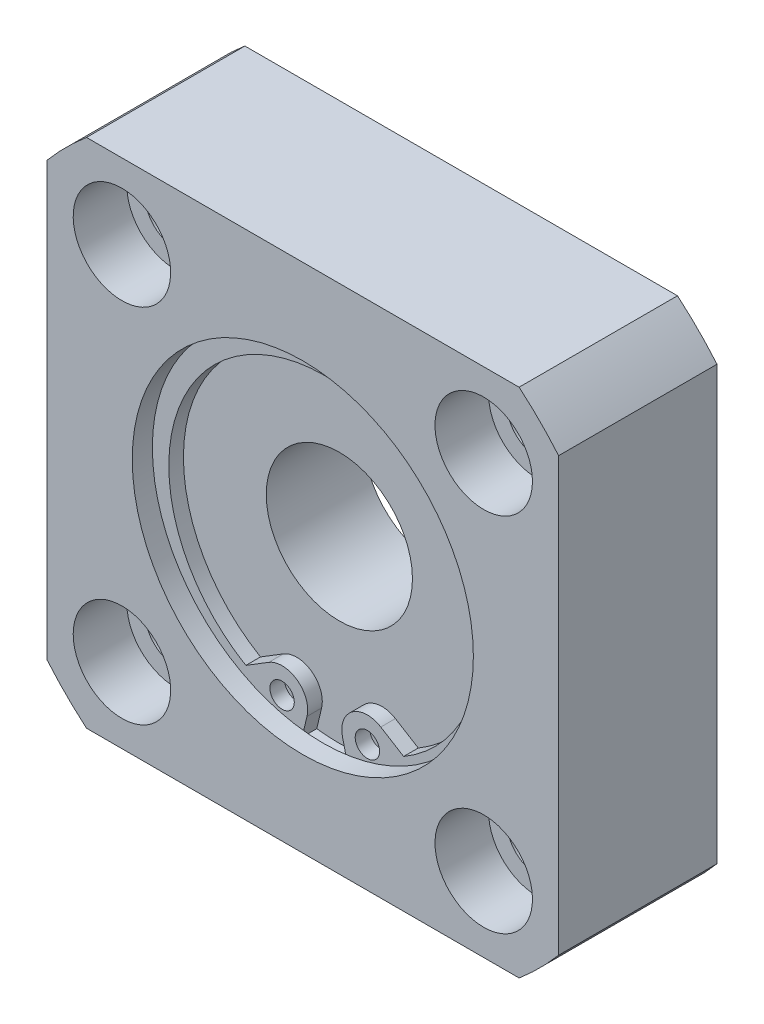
ISO-10303-21;
HEADER;
FILE_DESCRIPTION(('STEP AP214'),'2;1');
FILE_NAME('part.step','',(''),(''),'','','');
FILE_SCHEMA(('AUTOMOTIVE_DESIGN { 1 0 10303 214 1 1 1 1 }'));
ENDSEC;
DATA;
#1=APPLICATION_CONTEXT('core data for automotive mechanical design processes');
#2=APPLICATION_PROTOCOL_DEFINITION('international standard','automotive_design',2000,#1);
#3=PRODUCT_CONTEXT('',#1,'mechanical');
#4=PRODUCT('Part','Part','',(#3));
#5=PRODUCT_RELATED_PRODUCT_CATEGORY('part','',(#4));
#6=PRODUCT_DEFINITION_FORMATION('','',#4);
#7=PRODUCT_DEFINITION_CONTEXT('part definition',#1,'design');
#8=PRODUCT_DEFINITION('design','',#6,#7);
#9=PRODUCT_DEFINITION_SHAPE('','',#8);
#10=(LENGTH_UNIT() NAMED_UNIT(*) SI_UNIT(.MILLI.,.METRE.));
#11=(NAMED_UNIT(*) PLANE_ANGLE_UNIT() SI_UNIT($,.RADIAN.));
#12=(NAMED_UNIT(*) SI_UNIT($,.STERADIAN.) SOLID_ANGLE_UNIT());
#13=UNCERTAINTY_MEASURE_WITH_UNIT(LENGTH_MEASURE(1.E-05),#10,'distance_accuracy_value','');
#14=(GEOMETRIC_REPRESENTATION_CONTEXT(3) GLOBAL_UNCERTAINTY_ASSIGNED_CONTEXT((#13)) GLOBAL_UNIT_ASSIGNED_CONTEXT((#10,
#11,#12)) REPRESENTATION_CONTEXT('',''));
#15=CARTESIAN_POINT('',(0.,0.,0.));
#16=DIRECTION('',(0.,0.,1.));
#17=DIRECTION('',(1.,0.,0.));
#18=AXIS2_PLACEMENT_3D('',#15,#16,#17);
#19=CARTESIAN_POINT('',(0.,0.,10.));
#20=DIRECTION('',(0.,0.,1.));
#21=DIRECTION('',(1.,0.,0.));
#22=AXIS2_PLACEMENT_3D('',#19,#20,#21);
#23=PLANE('',#22);
#24=CARTESIAN_POINT('',(3.5,-12.4249666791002,10.));
#25=DIRECTION('',(0.,0.,1.));
#26=DIRECTION('',(1.,0.,0.));
#27=AXIS2_PLACEMENT_3D('',#24,#25,#26);
#28=CIRCLE('',#27,1.);
#29=CARTESIAN_POINT('',(4.5,-12.4249666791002,10.));
#30=VERTEX_POINT('',#29);
#31=EDGE_CURVE('E182',#30,#30,#28,.T.);
#32=ORIENTED_EDGE('',*,*,#31,.T.);
#33=EDGE_LOOP('',(#32));
#34=FACE_BOUND('',#33,.T.);
#35=ADVANCED_FACE('F14',(#34),#23,.T.);
#36=CARTESIAN_POINT('',(-3.5,-12.4249666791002,10.));
#37=DIRECTION('',(0.,0.,-1.));
#38=DIRECTION('',(1.,0.,0.));
#39=AXIS2_PLACEMENT_3D('',#36,#37,#38);
#40=CIRCLE('',#39,1.);
#41=CARTESIAN_POINT('',(-2.5,-12.4249666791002,10.));
#42=VERTEX_POINT('',#41);
#43=EDGE_CURVE('E174',#42,#42,#40,.T.);
#44=ORIENTED_EDGE('',*,*,#43,.F.);
#45=EDGE_LOOP('',(#44));
#46=FACE_BOUND('',#45,.T.);
#47=ADVANCED_FACE('F387',(#46),#23,.T.);
#48=CARTESIAN_POINT('',(14.8492424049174,14.8492424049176,8.6));
#49=DIRECTION('',(0.,0.,1.));
#50=DIRECTION('',(1.,0.,0.));
#51=AXIS2_PLACEMENT_3D('',#48,#49,#50);
#52=PLANE('',#51);
#53=CARTESIAN_POINT('',(14.8492424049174,14.8492424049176,8.6));
#54=DIRECTION('',(0.,0.,1.));
#55=DIRECTION('',(1.,0.,0.));
#56=AXIS2_PLACEMENT_3D('',#53,#54,#55);
#57=CIRCLE('',#56,4.);
#58=CARTESIAN_POINT('',(18.8492424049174,14.8492424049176,8.6));
#59=VERTEX_POINT('',#58);
#60=EDGE_CURVE('E284',#59,#59,#57,.T.);
#61=ORIENTED_EDGE('',*,*,#60,.T.);
#62=EDGE_LOOP('',(#61));
#63=FACE_BOUND('',#62,.T.);
#64=CARTESIAN_POINT('',(14.8492424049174,14.8492424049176,8.6));
#65=DIRECTION('',(0.,0.,1.));
#66=DIRECTION('',(1.,0.,0.));
#67=AXIS2_PLACEMENT_3D('',#64,#65,#66);
#68=CIRCLE('',#67,2.5);
#69=CARTESIAN_POINT('',(17.3492424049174,14.8492424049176,8.6));
#70=VERTEX_POINT('',#69);
#71=EDGE_CURVE('E287',#70,#70,#68,.F.);
#72=ORIENTED_EDGE('',*,*,#71,.T.);
#73=EDGE_LOOP('',(#72));
#74=FACE_BOUND('',#73,.T.);
#75=ADVANCED_FACE('F395',(#63,#74),#52,.T.);
#76=CARTESIAN_POINT('',(14.8492424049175,-14.8492424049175,8.6));
#77=DIRECTION('',(0.,0.,1.));
#78=DIRECTION('',(0.,-1.,0.));
#79=AXIS2_PLACEMENT_3D('',#76,#77,#78);
#80=PLANE('',#79);
#81=CARTESIAN_POINT('',(14.8492424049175,-14.8492424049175,8.6));
#82=DIRECTION('',(0.,0.,1.));
#83=DIRECTION('',(0.,-1.,0.));
#84=AXIS2_PLACEMENT_3D('',#81,#82,#83);
#85=CIRCLE('',#84,4.);
#86=CARTESIAN_POINT('',(14.8492424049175,-18.8492424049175,8.6));
#87=VERTEX_POINT('',#86);
#88=EDGE_CURVE('E268',#87,#87,#85,.T.);
#89=ORIENTED_EDGE('',*,*,#88,.T.);
#90=EDGE_LOOP('',(#89));
#91=FACE_BOUND('',#90,.T.);
#92=CARTESIAN_POINT('',(14.8492424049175,-14.8492424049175,8.6));
#93=DIRECTION('',(0.,0.,1.));
#94=DIRECTION('',(1.,0.,0.));
#95=AXIS2_PLACEMENT_3D('',#92,#93,#94);
#96=CIRCLE('',#95,2.5);
#97=CARTESIAN_POINT('',(17.3492424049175,-14.8492424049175,8.6));
#98=VERTEX_POINT('',#97);
#99=EDGE_CURVE('E271',#98,#98,#96,.F.);
#100=ORIENTED_EDGE('',*,*,#99,.T.);
#101=EDGE_LOOP('',(#100));
#102=FACE_BOUND('',#101,.T.);
#103=ADVANCED_FACE('F826',(#91,#102),#80,.T.);
#104=CARTESIAN_POINT('',(-14.8492424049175,-14.8492424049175,8.6));
#105=DIRECTION('',(0.,0.,1.));
#106=DIRECTION('',(-1.,0.,0.));
#107=AXIS2_PLACEMENT_3D('',#104,#105,#106);
#108=PLANE('',#107);
#109=CARTESIAN_POINT('',(-14.8492424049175,-14.8492424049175,8.6));
#110=DIRECTION('',(0.,0.,1.));
#111=DIRECTION('',(-1.,0.,0.));
#112=AXIS2_PLACEMENT_3D('',#109,#110,#111);
#113=CIRCLE('',#112,4.);
#114=CARTESIAN_POINT('',(-18.8492424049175,-14.8492424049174,8.6));
#115=VERTEX_POINT('',#114);
#116=EDGE_CURVE('E261',#115,#115,#113,.T.);
#117=ORIENTED_EDGE('',*,*,#116,.T.);
#118=EDGE_LOOP('',(#117));
#119=FACE_BOUND('',#118,.T.);
#120=CARTESIAN_POINT('',(-14.8492424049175,-14.8492424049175,8.6));
#121=DIRECTION('',(0.,0.,1.));
#122=DIRECTION('',(1.,0.,0.));
#123=AXIS2_PLACEMENT_3D('',#120,#121,#122);
#124=CIRCLE('',#123,2.5);
#125=CARTESIAN_POINT('',(-12.3492424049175,-14.8492424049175,8.6));
#126=VERTEX_POINT('',#125);
#127=EDGE_CURVE('E264',#126,#126,#124,.F.);
#128=ORIENTED_EDGE('',*,*,#127,.T.);
#129=EDGE_LOOP('',(#128));
#130=FACE_BOUND('',#129,.T.);
#131=ADVANCED_FACE('F816',(#119,#130),#108,.T.);
#132=CARTESIAN_POINT('',(-14.8492424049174,14.8492424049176,8.6));
#133=DIRECTION('',(0.,0.,1.));
#134=DIRECTION('',(0.,1.,0.));
#135=AXIS2_PLACEMENT_3D('',#132,#133,#134);
#136=PLANE('',#135);
#137=CARTESIAN_POINT('',(-14.8492424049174,14.8492424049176,8.6));
#138=DIRECTION('',(0.,0.,1.));
#139=DIRECTION('',(0.,1.,0.));
#140=AXIS2_PLACEMENT_3D('',#137,#138,#139);
#141=CIRCLE('',#140,4.);
#142=CARTESIAN_POINT('',(-14.8492424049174,18.8492424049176,8.6));
#143=VERTEX_POINT('',#142);
#144=EDGE_CURVE('E254',#143,#143,#141,.T.);
#145=ORIENTED_EDGE('',*,*,#144,.T.);
#146=EDGE_LOOP('',(#145));
#147=FACE_BOUND('',#146,.T.);
#148=CARTESIAN_POINT('',(-14.8492424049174,14.8492424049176,8.6));
#149=DIRECTION('',(0.,0.,1.));
#150=DIRECTION('',(1.,0.,0.));
#151=AXIS2_PLACEMENT_3D('',#148,#149,#150);
#152=CIRCLE('',#151,2.5);
#153=CARTESIAN_POINT('',(-12.3492424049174,14.8492424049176,8.6));
#154=VERTEX_POINT('',#153);
#155=EDGE_CURVE('E257',#154,#154,#152,.F.);
#156=ORIENTED_EDGE('',*,*,#155,.T.);
#157=EDGE_LOOP('',(#156));
#158=FACE_BOUND('',#157,.T.);
#159=ADVANCED_FACE('F806',(#147,#158),#136,.T.);
#160=CARTESIAN_POINT('',(14.8492424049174,14.8492424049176,0.));
#161=DIRECTION('',(0.,0.,1.));
#162=DIRECTION('',(1.,0.,0.));
#163=AXIS2_PLACEMENT_3D('',#160,#161,#162);
#164=CYLINDRICAL_SURFACE('',#163,2.5);
#165=CARTESIAN_POINT('',(14.8492424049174,14.8492424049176,0.));
#166=DIRECTION('',(0.,0.,1.));
#167=DIRECTION('',(1.,0.,0.));
#168=AXIS2_PLACEMENT_3D('',#165,#166,#167);
#169=CIRCLE('',#168,2.5);
#170=CARTESIAN_POINT('',(17.3492424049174,14.8492424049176,0.));
#171=VERTEX_POINT('',#170);
#172=EDGE_CURVE('E288',#171,#171,#169,.T.);
#173=ORIENTED_EDGE('',*,*,#172,.F.);
#174=EDGE_LOOP('',(#173));
#175=FACE_BOUND('',#174,.T.);
#176=ORIENTED_EDGE('',*,*,#71,.F.);
#177=EDGE_LOOP('',(#176));
#178=FACE_BOUND('',#177,.T.);
#179=ADVANCED_FACE('F796',(#175,#178),#164,.F.);
#180=CARTESIAN_POINT('',(14.8492424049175,-14.8492424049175,0.));
#181=DIRECTION('',(0.,0.,1.));
#182=DIRECTION('',(1.,0.,0.));
#183=AXIS2_PLACEMENT_3D('',#180,#181,#182);
#184=CYLINDRICAL_SURFACE('',#183,2.5);
#185=CARTESIAN_POINT('',(14.8492424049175,-14.8492424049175,0.));
#186=DIRECTION('',(0.,0.,1.));
#187=DIRECTION('',(0.,-1.,0.));
#188=AXIS2_PLACEMENT_3D('',#185,#186,#187);
#189=CIRCLE('',#188,2.5);
#190=CARTESIAN_POINT('',(14.8492424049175,-17.3492424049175,0.));
#191=VERTEX_POINT('',#190);
#192=EDGE_CURVE('E278',#191,#191,#189,.T.);
#193=ORIENTED_EDGE('',*,*,#192,.F.);
#194=EDGE_LOOP('',(#193));
#195=FACE_BOUND('',#194,.T.);
#196=ORIENTED_EDGE('',*,*,#99,.F.);
#197=EDGE_LOOP('',(#196));
#198=FACE_BOUND('',#197,.T.);
#199=ADVANCED_FACE('F786',(#195,#198),#184,.F.);
#200=CARTESIAN_POINT('',(-14.8492424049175,-14.8492424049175,0.));
#201=DIRECTION('',(0.,0.,1.));
#202=DIRECTION('',(1.,0.,0.));
#203=AXIS2_PLACEMENT_3D('',#200,#201,#202);
#204=CYLINDRICAL_SURFACE('',#203,2.5);
#205=CARTESIAN_POINT('',(-14.8492424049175,-14.8492424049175,0.));
#206=DIRECTION('',(0.,0.,1.));
#207=DIRECTION('',(-1.,0.,0.));
#208=AXIS2_PLACEMENT_3D('',#205,#206,#207);
#209=CIRCLE('',#208,2.5);
#210=CARTESIAN_POINT('',(-17.3492424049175,-14.8492424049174,0.));
#211=VERTEX_POINT('',#210);
#212=EDGE_CURVE('E275',#211,#211,#209,.T.);
#213=ORIENTED_EDGE('',*,*,#212,.F.);
#214=EDGE_LOOP('',(#213));
#215=FACE_BOUND('',#214,.T.);
#216=ORIENTED_EDGE('',*,*,#127,.F.);
#217=EDGE_LOOP('',(#216));
#218=FACE_BOUND('',#217,.T.);
#219=ADVANCED_FACE('F776',(#215,#218),#204,.F.);
#220=CARTESIAN_POINT('',(-14.8492424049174,14.8492424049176,0.));
#221=DIRECTION('',(0.,0.,1.));
#222=DIRECTION('',(1.,0.,0.));
#223=AXIS2_PLACEMENT_3D('',#220,#221,#222);
#224=CYLINDRICAL_SURFACE('',#223,2.5);
#225=CARTESIAN_POINT('',(-14.8492424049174,14.8492424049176,0.));
#226=DIRECTION('',(0.,0.,1.));
#227=DIRECTION('',(0.,1.,0.));
#228=AXIS2_PLACEMENT_3D('',#225,#226,#227);
#229=CIRCLE('',#228,2.5);
#230=CARTESIAN_POINT('',(-14.8492424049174,17.3492424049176,0.));
#231=VERTEX_POINT('',#230);
#232=EDGE_CURVE('E272',#231,#231,#229,.T.);
#233=ORIENTED_EDGE('',*,*,#232,.F.);
#234=EDGE_LOOP('',(#233));
#235=FACE_BOUND('',#234,.T.);
#236=ORIENTED_EDGE('',*,*,#155,.F.);
#237=EDGE_LOOP('',(#236));
#238=FACE_BOUND('',#237,.T.);
#239=ADVANCED_FACE('F766',(#235,#238),#224,.F.);
#240=CARTESIAN_POINT('',(-17.7552809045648,-21.,13.));
#241=DIRECTION('',(0.,1.,0.));
#242=DIRECTION('',(0.,0.,1.));
#243=AXIS2_PLACEMENT_3D('',#240,#241,#242);
#244=PLANE('',#243);
#245=DIRECTION('',(1.,0.,0.));
#246=VECTOR('',#245,1.);
#247=CARTESIAN_POINT('',(-17.7552809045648,-21.,13.));
#248=LINE('',#247,#246);
#249=CARTESIAN_POINT('',(-17.7552809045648,-21.,13.));
#250=VERTEX_POINT('',#249);
#251=CARTESIAN_POINT('',(17.7552809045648,-21.,13.));
#252=VERTEX_POINT('',#251);
#253=EDGE_CURVE('E316',#250,#252,#248,.T.);
#254=ORIENTED_EDGE('',*,*,#253,.F.);
#255=DIRECTION('',(0.,0.,-1.));
#256=VECTOR('',#255,1.);
#257=CARTESIAN_POINT('',(-17.7552809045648,-21.,13.));
#258=LINE('',#257,#256);
#259=CARTESIAN_POINT('',(-17.7552809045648,-21.,0.));
#260=VERTEX_POINT('',#259);
#261=EDGE_CURVE('E339',#250,#260,#258,.T.);
#262=ORIENTED_EDGE('',*,*,#261,.T.);
#263=DIRECTION('',(1.,0.,0.));
#264=VECTOR('',#263,1.);
#265=CARTESIAN_POINT('',(-17.7552809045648,-21.,0.));
#266=LINE('',#265,#264);
#267=CARTESIAN_POINT('',(17.7552809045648,-21.,0.));
#268=VERTEX_POINT('',#267);
#269=EDGE_CURVE('E294',#260,#268,#266,.T.);
#270=ORIENTED_EDGE('',*,*,#269,.T.);
#271=DIRECTION('',(0.,0.,-1.));
#272=VECTOR('',#271,1.);
#273=CARTESIAN_POINT('',(17.7552809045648,-21.,13.));
#274=LINE('',#273,#272);
#275=EDGE_CURVE('E337',#252,#268,#274,.T.);
#276=ORIENTED_EDGE('',*,*,#275,.F.);
#277=EDGE_LOOP('',(#254,#262,#270,#276));
#278=FACE_BOUND('',#277,.T.);
#279=ADVANCED_FACE('F756',(#278),#244,.F.);
#280=CARTESIAN_POINT('',(0.,0.,13.));
#281=DIRECTION('',(0.,0.,-1.));
#282=DIRECTION('',(-1.,0.,0.));
#283=AXIS2_PLACEMENT_3D('',#280,#281,#282);
#284=CYLINDRICAL_SURFACE('',#283,27.5);
#285=ORIENTED_EDGE('',*,*,#261,.F.);
#286=CARTESIAN_POINT('',(0.,0.,13.));
#287=DIRECTION('',(0.,0.,1.));
#288=DIRECTION('',(1.,0.,0.));
#289=AXIS2_PLACEMENT_3D('',#286,#287,#288);
#290=CIRCLE('',#289,27.5);
#291=CARTESIAN_POINT('',(-21.,-17.7552809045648,13.));
#292=VERTEX_POINT('',#291);
#293=EDGE_CURVE('E319',#292,#250,#290,.T.);
#294=ORIENTED_EDGE('',*,*,#293,.F.);
#295=DIRECTION('',(0.,0.,-1.));
#296=VECTOR('',#295,1.);
#297=CARTESIAN_POINT('',(-21.,-17.7552809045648,13.));
#298=LINE('',#297,#296);
#299=CARTESIAN_POINT('',(-21.,-17.7552809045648,0.));
#300=VERTEX_POINT('',#299);
#301=EDGE_CURVE('E341',#292,#300,#298,.T.);
#302=ORIENTED_EDGE('',*,*,#301,.T.);
#303=CARTESIAN_POINT('',(0.,0.,0.));
#304=DIRECTION('',(0.,0.,1.));
#305=DIRECTION('',(1.,0.,0.));
#306=AXIS2_PLACEMENT_3D('',#303,#304,#305);
#307=CIRCLE('',#306,27.5);
#308=EDGE_CURVE('E297',#300,#260,#307,.T.);
#309=ORIENTED_EDGE('',*,*,#308,.T.);
#310=EDGE_LOOP('',(#285,#294,#302,#309));
#311=FACE_BOUND('',#310,.T.);
#312=ADVANCED_FACE('F746',(#311),#284,.T.);
#313=CARTESIAN_POINT('',(-21.,-17.7552809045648,13.));
#314=DIRECTION('',(-1.,0.,0.));
#315=DIRECTION('',(0.,0.,1.));
#316=AXIS2_PLACEMENT_3D('',#313,#314,#315);
#317=PLANE('',#316);
#318=ORIENTED_EDGE('',*,*,#301,.F.);
#319=DIRECTION('',(0.,1.,0.));
#320=VECTOR('',#319,1.);
#321=CARTESIAN_POINT('',(-21.,-17.7552809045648,13.));
#322=LINE('',#321,#320);
#323=CARTESIAN_POINT('',(-21.,17.7552809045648,13.));
#324=VERTEX_POINT('',#323);
#325=EDGE_CURVE('E322',#292,#324,#322,.T.);
#326=ORIENTED_EDGE('',*,*,#325,.T.);
#327=DIRECTION('',(0.,0.,-1.));
#328=VECTOR('',#327,1.);
#329=CARTESIAN_POINT('',(-21.,17.7552809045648,13.));
#330=LINE('',#329,#328);
#331=CARTESIAN_POINT('',(-21.,17.7552809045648,0.));
#332=VERTEX_POINT('',#331);
#333=EDGE_CURVE('E343',#324,#332,#330,.T.);
#334=ORIENTED_EDGE('',*,*,#333,.T.);
#335=DIRECTION('',(0.,1.,0.));
#336=VECTOR('',#335,1.);
#337=CARTESIAN_POINT('',(-21.,-17.7552809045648,0.));
#338=LINE('',#337,#336);
#339=EDGE_CURVE('E300',#300,#332,#338,.T.);
#340=ORIENTED_EDGE('',*,*,#339,.F.);
#341=EDGE_LOOP('',(#318,#326,#334,#340));
#342=FACE_BOUND('',#341,.T.);
#343=ADVANCED_FACE('F736',(#342),#317,.T.);
#344=CARTESIAN_POINT('',(0.,0.,13.));
#345=DIRECTION('',(0.,0.,-1.));
#346=DIRECTION('',(-1.,0.,0.));
#347=AXIS2_PLACEMENT_3D('',#344,#345,#346);
#348=CYLINDRICAL_SURFACE('',#347,27.5);
#349=ORIENTED_EDGE('',*,*,#333,.F.);
#350=CARTESIAN_POINT('',(0.,0.,13.));
#351=DIRECTION('',(0.,0.,-1.));
#352=DIRECTION('',(-1.,0.,0.));
#353=AXIS2_PLACEMENT_3D('',#350,#351,#352);
#354=CIRCLE('',#353,27.5);
#355=CARTESIAN_POINT('',(-17.7552809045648,21.,13.));
#356=VERTEX_POINT('',#355);
#357=EDGE_CURVE('E325',#324,#356,#354,.T.);
#358=ORIENTED_EDGE('',*,*,#357,.T.);
#359=DIRECTION('',(0.,0.,-1.));
#360=VECTOR('',#359,1.);
#361=CARTESIAN_POINT('',(-17.7552809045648,21.,13.));
#362=LINE('',#361,#360);
#363=CARTESIAN_POINT('',(-17.7552809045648,21.,0.));
#364=VERTEX_POINT('',#363);
#365=EDGE_CURVE('E345',#356,#364,#362,.T.);
#366=ORIENTED_EDGE('',*,*,#365,.T.);
#367=CARTESIAN_POINT('',(0.,0.,0.));
#368=DIRECTION('',(0.,0.,-1.));
#369=DIRECTION('',(-1.,0.,0.));
#370=AXIS2_PLACEMENT_3D('',#367,#368,#369);
#371=CIRCLE('',#370,27.5);
#372=EDGE_CURVE('E303',#332,#364,#371,.T.);
#373=ORIENTED_EDGE('',*,*,#372,.F.);
#374=EDGE_LOOP('',(#349,#358,#366,#373));
#375=FACE_BOUND('',#374,.T.);
#376=ADVANCED_FACE('F726',(#375),#348,.T.);
#377=CARTESIAN_POINT('',(-17.7552809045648,21.,13.));
#378=DIRECTION('',(0.,1.,0.));
#379=DIRECTION('',(0.,0.,1.));
#380=AXIS2_PLACEMENT_3D('',#377,#378,#379);
#381=PLANE('',#380);
#382=ORIENTED_EDGE('',*,*,#365,.F.);
#383=DIRECTION('',(1.,0.,0.));
#384=VECTOR('',#383,1.);
#385=CARTESIAN_POINT('',(-17.7552809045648,21.,13.));
#386=LINE('',#385,#384);
#387=CARTESIAN_POINT('',(17.7552809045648,21.,13.));
#388=VERTEX_POINT('',#387);
#389=EDGE_CURVE('E328',#356,#388,#386,.T.);
#390=ORIENTED_EDGE('',*,*,#389,.T.);
#391=DIRECTION('',(0.,0.,-1.));
#392=VECTOR('',#391,1.);
#393=CARTESIAN_POINT('',(17.7552809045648,21.,13.));
#394=LINE('',#393,#392);
#395=CARTESIAN_POINT('',(17.7552809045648,21.,0.));
#396=VERTEX_POINT('',#395);
#397=EDGE_CURVE('E347',#388,#396,#394,.T.);
#398=ORIENTED_EDGE('',*,*,#397,.T.);
#399=DIRECTION('',(1.,0.,0.));
#400=VECTOR('',#399,1.);
#401=CARTESIAN_POINT('',(-17.7552809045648,21.,0.));
#402=LINE('',#401,#400);
#403=EDGE_CURVE('E306',#364,#396,#402,.T.);
#404=ORIENTED_EDGE('',*,*,#403,.F.);
#405=EDGE_LOOP('',(#382,#390,#398,#404));
#406=FACE_BOUND('',#405,.T.);
#407=ADVANCED_FACE('F717',(#406),#381,.T.);
#408=CARTESIAN_POINT('',(0.,0.,13.));
#409=DIRECTION('',(0.,0.,-1.));
#410=DIRECTION('',(-1.,0.,0.));
#411=AXIS2_PLACEMENT_3D('',#408,#409,#410);
#412=CYLINDRICAL_SURFACE('',#411,27.5);
#413=ORIENTED_EDGE('',*,*,#397,.F.);
#414=CARTESIAN_POINT('',(0.,0.,13.));
#415=DIRECTION('',(0.,0.,1.));
#416=DIRECTION('',(1.,0.,0.));
#417=AXIS2_PLACEMENT_3D('',#414,#415,#416);
#418=CIRCLE('',#417,27.5);
#419=CARTESIAN_POINT('',(21.,17.7552809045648,13.));
#420=VERTEX_POINT('',#419);
#421=EDGE_CURVE('E331',#420,#388,#418,.T.);
#422=ORIENTED_EDGE('',*,*,#421,.F.);
#423=DIRECTION('',(0.,0.,-1.));
#424=VECTOR('',#423,1.);
#425=CARTESIAN_POINT('',(21.,17.7552809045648,13.));
#426=LINE('',#425,#424);
#427=CARTESIAN_POINT('',(21.,17.7552809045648,0.));
#428=VERTEX_POINT('',#427);
#429=EDGE_CURVE('E82',#420,#428,#426,.T.);
#430=ORIENTED_EDGE('',*,*,#429,.T.);
#431=CARTESIAN_POINT('',(0.,0.,0.));
#432=DIRECTION('',(0.,0.,1.));
#433=DIRECTION('',(1.,0.,0.));
#434=AXIS2_PLACEMENT_3D('',#431,#432,#433);
#435=CIRCLE('',#434,27.5);
#436=EDGE_CURVE('E309',#428,#396,#435,.T.);
#437=ORIENTED_EDGE('',*,*,#436,.T.);
#438=EDGE_LOOP('',(#413,#422,#430,#437));
#439=FACE_BOUND('',#438,.T.);
#440=ADVANCED_FACE('F709',(#439),#412,.T.);
#441=CARTESIAN_POINT('',(21.,-17.7552809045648,13.));
#442=DIRECTION('',(-1.,0.,0.));
#443=DIRECTION('',(0.,0.,1.));
#444=AXIS2_PLACEMENT_3D('',#441,#442,#443);
#445=PLANE('',#444);
#446=ORIENTED_EDGE('',*,*,#429,.F.);
#447=DIRECTION('',(0.,1.,0.));
#448=VECTOR('',#447,1.);
#449=CARTESIAN_POINT('',(21.,-17.7552809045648,13.));
#450=LINE('',#449,#448);
#451=CARTESIAN_POINT('',(21.,-17.7552809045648,13.));
#452=VERTEX_POINT('',#451);
#453=EDGE_CURVE('E334',#452,#420,#450,.T.);
#454=ORIENTED_EDGE('',*,*,#453,.F.);
#455=DIRECTION('',(0.,0.,-1.));
#456=VECTOR('',#455,1.);
#457=CARTESIAN_POINT('',(21.,-17.7552809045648,13.));
#458=LINE('',#457,#456);
#459=CARTESIAN_POINT('',(21.,-17.7552809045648,0.));
#460=VERTEX_POINT('',#459);
#461=EDGE_CURVE('E89',#452,#460,#458,.T.);
#462=ORIENTED_EDGE('',*,*,#461,.T.);
#463=DIRECTION('',(0.,1.,0.));
#464=VECTOR('',#463,1.);
#465=CARTESIAN_POINT('',(21.,-17.7552809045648,0.));
#466=LINE('',#465,#464);
#467=EDGE_CURVE('E312',#460,#428,#466,.T.);
#468=ORIENTED_EDGE('',*,*,#467,.T.);
#469=EDGE_LOOP('',(#446,#454,#462,#468));
#470=FACE_BOUND('',#469,.T.);
#471=ADVANCED_FACE('F16',(#470),#445,.F.);
#472=CARTESIAN_POINT('',(0.,0.,13.));
#473=DIRECTION('',(0.,0.,-1.));
#474=DIRECTION('',(-1.,0.,0.));
#475=AXIS2_PLACEMENT_3D('',#472,#473,#474);
#476=CYLINDRICAL_SURFACE('',#475,27.5);
#477=ORIENTED_EDGE('',*,*,#461,.F.);
#478=CARTESIAN_POINT('',(0.,0.,13.));
#479=DIRECTION('',(0.,0.,-1.));
#480=DIRECTION('',(-1.,0.,0.));
#481=AXIS2_PLACEMENT_3D('',#478,#479,#480);
#482=CIRCLE('',#481,27.5);
#483=EDGE_CURVE('E314',#452,#252,#482,.T.);
#484=ORIENTED_EDGE('',*,*,#483,.T.);
#485=ORIENTED_EDGE('',*,*,#275,.T.);
#486=CARTESIAN_POINT('',(0.,0.,0.));
#487=DIRECTION('',(0.,0.,-1.));
#488=DIRECTION('',(-1.,0.,0.));
#489=AXIS2_PLACEMENT_3D('',#486,#487,#488);
#490=CIRCLE('',#489,27.5);
#491=EDGE_CURVE('E291',#460,#268,#490,.T.);
#492=ORIENTED_EDGE('',*,*,#491,.F.);
#493=EDGE_LOOP('',(#477,#484,#485,#492));
#494=FACE_BOUND('',#493,.T.);
#495=ADVANCED_FACE('F691',(#494),#476,.T.);
#496=CARTESIAN_POINT('',(14.8492424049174,14.8492424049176,8.6));
#497=DIRECTION('',(0.,0.,1.));
#498=DIRECTION('',(1.,0.,0.));
#499=AXIS2_PLACEMENT_3D('',#496,#497,#498);
#500=CYLINDRICAL_SURFACE('',#499,4.);
#501=ORIENTED_EDGE('',*,*,#60,.F.);
#502=EDGE_LOOP('',(#501));
#503=FACE_BOUND('',#502,.T.);
#504=CARTESIAN_POINT('',(14.8492424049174,14.8492424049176,13.));
#505=DIRECTION('',(0.,0.,1.));
#506=DIRECTION('',(1.,0.,0.));
#507=AXIS2_PLACEMENT_3D('',#504,#505,#506);
#508=CIRCLE('',#507,4.);
#509=CARTESIAN_POINT('',(18.8492424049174,14.8492424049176,13.));
#510=VERTEX_POINT('',#509);
#511=EDGE_CURVE('E281',#510,#510,#508,.T.);
#512=ORIENTED_EDGE('',*,*,#511,.T.);
#513=EDGE_LOOP('',(#512));
#514=FACE_BOUND('',#513,.T.);
#515=ADVANCED_FACE('F681',(#503,#514),#500,.F.);
#516=CARTESIAN_POINT('',(14.8492424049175,-14.8492424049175,8.6));
#517=DIRECTION('',(0.,0.,1.));
#518=DIRECTION('',(1.,0.,0.));
#519=AXIS2_PLACEMENT_3D('',#516,#517,#518);
#520=CYLINDRICAL_SURFACE('',#519,4.);
#521=ORIENTED_EDGE('',*,*,#88,.F.);
#522=EDGE_LOOP('',(#521));
#523=FACE_BOUND('',#522,.T.);
#524=CARTESIAN_POINT('',(14.8492424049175,-14.8492424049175,13.));
#525=DIRECTION('',(0.,0.,1.));
#526=DIRECTION('',(0.,-1.,0.));
#527=AXIS2_PLACEMENT_3D('',#524,#525,#526);
#528=CIRCLE('',#527,4.);
#529=CARTESIAN_POINT('',(14.8492424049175,-18.8492424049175,13.));
#530=VERTEX_POINT('',#529);
#531=EDGE_CURVE('E265',#530,#530,#528,.T.);
#532=ORIENTED_EDGE('',*,*,#531,.T.);
#533=EDGE_LOOP('',(#532));
#534=FACE_BOUND('',#533,.T.);
#535=ADVANCED_FACE('F671',(#523,#534),#520,.F.);
#536=CARTESIAN_POINT('',(-14.8492424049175,-14.8492424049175,8.6));
#537=DIRECTION('',(0.,0.,1.));
#538=DIRECTION('',(1.,0.,0.));
#539=AXIS2_PLACEMENT_3D('',#536,#537,#538);
#540=CYLINDRICAL_SURFACE('',#539,4.);
#541=ORIENTED_EDGE('',*,*,#116,.F.);
#542=EDGE_LOOP('',(#541));
#543=FACE_BOUND('',#542,.T.);
#544=CARTESIAN_POINT('',(-14.8492424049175,-14.8492424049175,13.));
#545=DIRECTION('',(0.,0.,1.));
#546=DIRECTION('',(-1.,0.,0.));
#547=AXIS2_PLACEMENT_3D('',#544,#545,#546);
#548=CIRCLE('',#547,4.);
#549=CARTESIAN_POINT('',(-18.8492424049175,-14.8492424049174,13.));
#550=VERTEX_POINT('',#549);
#551=EDGE_CURVE('E258',#550,#550,#548,.T.);
#552=ORIENTED_EDGE('',*,*,#551,.T.);
#553=EDGE_LOOP('',(#552));
#554=FACE_BOUND('',#553,.T.);
#555=ADVANCED_FACE('F661',(#543,#554),#540,.F.);
#556=CARTESIAN_POINT('',(-14.8492424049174,14.8492424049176,8.6));
#557=DIRECTION('',(0.,0.,1.));
#558=DIRECTION('',(1.,0.,0.));
#559=AXIS2_PLACEMENT_3D('',#556,#557,#558);
#560=CYLINDRICAL_SURFACE('',#559,4.);
#561=ORIENTED_EDGE('',*,*,#144,.F.);
#562=EDGE_LOOP('',(#561));
#563=FACE_BOUND('',#562,.T.);
#564=CARTESIAN_POINT('',(-14.8492424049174,14.8492424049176,13.));
#565=DIRECTION('',(0.,0.,1.));
#566=DIRECTION('',(0.,1.,0.));
#567=AXIS2_PLACEMENT_3D('',#564,#565,#566);
#568=CIRCLE('',#567,4.);
#569=CARTESIAN_POINT('',(-14.8492424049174,18.8492424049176,13.));
#570=VERTEX_POINT('',#569);
#571=EDGE_CURVE('E251',#570,#570,#568,.T.);
#572=ORIENTED_EDGE('',*,*,#571,.T.);
#573=EDGE_LOOP('',(#572));
#574=FACE_BOUND('',#573,.T.);
#575=ADVANCED_FACE('F651',(#563,#574),#560,.F.);
#576=CARTESIAN_POINT('',(0.,0.,0.));
#577=DIRECTION('',(0.,0.,-1.));
#578=DIRECTION('',(-1.,0.,0.));
#579=AXIS2_PLACEMENT_3D('',#576,#577,#578);
#580=PLANE('',#579);
#581=CARTESIAN_POINT('',(0.,0.,0.));
#582=DIRECTION('',(0.,0.,-1.));
#583=DIRECTION('',(-1.,0.,0.));
#584=AXIS2_PLACEMENT_3D('',#581,#582,#583);
#585=CIRCLE('',#584,12.);
#586=CARTESIAN_POINT('',(-12.,0.,0.));
#587=VERTEX_POINT('',#586);
#588=EDGE_CURVE('E240',#587,#587,#585,.T.);
#589=ORIENTED_EDGE('',*,*,#588,.F.);
#590=EDGE_LOOP('',(#589));
#591=FACE_BOUND('',#590,.T.);
#592=ORIENTED_EDGE('',*,*,#232,.T.);
#593=EDGE_LOOP('',(#592));
#594=FACE_BOUND('',#593,.T.);
#595=ORIENTED_EDGE('',*,*,#212,.T.);
#596=EDGE_LOOP('',(#595));
#597=FACE_BOUND('',#596,.T.);
#598=ORIENTED_EDGE('',*,*,#192,.T.);
#599=EDGE_LOOP('',(#598));
#600=FACE_BOUND('',#599,.T.);
#601=ORIENTED_EDGE('',*,*,#172,.T.);
#602=EDGE_LOOP('',(#601));
#603=FACE_BOUND('',#602,.T.);
#604=ORIENTED_EDGE('',*,*,#491,.T.);
#605=ORIENTED_EDGE('',*,*,#269,.F.);
#606=ORIENTED_EDGE('',*,*,#308,.F.);
#607=ORIENTED_EDGE('',*,*,#339,.T.);
#608=ORIENTED_EDGE('',*,*,#372,.T.);
#609=ORIENTED_EDGE('',*,*,#403,.T.);
#610=ORIENTED_EDGE('',*,*,#436,.F.);
#611=ORIENTED_EDGE('',*,*,#467,.F.);
#612=EDGE_LOOP('',(#604,#605,#606,#607,#608,#609,#610,#611));
#613=FACE_BOUND('',#612,.T.);
#614=ADVANCED_FACE('F641',(#591,#594,#597,#600,#603,#613),#580,.T.);
#615=CARTESIAN_POINT('',(0.,0.,13.));
#616=DIRECTION('',(0.,0.,-1.));
#617=DIRECTION('',(-1.,0.,0.));
#618=AXIS2_PLACEMENT_3D('',#615,#616,#617);
#619=PLANE('',#618);
#620=CARTESIAN_POINT('',(0.,0.,13.));
#621=DIRECTION('',(0.,0.,1.));
#622=DIRECTION('',(1.,0.,0.));
#623=AXIS2_PLACEMENT_3D('',#620,#621,#622);
#624=CIRCLE('',#623,14.);
#625=CARTESIAN_POINT('',(14.,0.,13.));
#626=VERTEX_POINT('',#625);
#627=EDGE_CURVE('E247',#626,#626,#624,.T.);
#628=ORIENTED_EDGE('',*,*,#627,.F.);
#629=EDGE_LOOP('',(#628));
#630=FACE_BOUND('',#629,.T.);
#631=ORIENTED_EDGE('',*,*,#571,.F.);
#632=EDGE_LOOP('',(#631));
#633=FACE_BOUND('',#632,.T.);
#634=ORIENTED_EDGE('',*,*,#551,.F.);
#635=EDGE_LOOP('',(#634));
#636=FACE_BOUND('',#635,.T.);
#637=ORIENTED_EDGE('',*,*,#531,.F.);
#638=EDGE_LOOP('',(#637));
#639=FACE_BOUND('',#638,.T.);
#640=ORIENTED_EDGE('',*,*,#511,.F.);
#641=EDGE_LOOP('',(#640));
#642=FACE_BOUND('',#641,.T.);
#643=ORIENTED_EDGE('',*,*,#483,.F.);
#644=ORIENTED_EDGE('',*,*,#453,.T.);
#645=ORIENTED_EDGE('',*,*,#421,.T.);
#646=ORIENTED_EDGE('',*,*,#389,.F.);
#647=ORIENTED_EDGE('',*,*,#357,.F.);
#648=ORIENTED_EDGE('',*,*,#325,.F.);
#649=ORIENTED_EDGE('',*,*,#293,.T.);
#650=ORIENTED_EDGE('',*,*,#253,.T.);
#651=EDGE_LOOP('',(#643,#644,#645,#646,#647,#648,#649,#650));
#652=FACE_BOUND('',#651,.T.);
#653=ADVANCED_FACE('F632',(#630,#633,#636,#639,#642,#652),#619,.F.);
#654=CARTESIAN_POINT('',(0.,0.,2.));
#655=DIRECTION('',(0.,0.,-1.));
#656=DIRECTION('',(-1.,0.,0.));
#657=AXIS2_PLACEMENT_3D('',#654,#655,#656);
#658=CYLINDRICAL_SURFACE('',#657,12.);
#659=CARTESIAN_POINT('',(0.,0.,2.));
#660=DIRECTION('',(0.,0.,-1.));
#661=DIRECTION('',(-1.,0.,0.));
#662=AXIS2_PLACEMENT_3D('',#659,#660,#661);
#663=CIRCLE('',#662,12.);
#664=CARTESIAN_POINT('',(-12.,0.,2.));
#665=VERTEX_POINT('',#664);
#666=EDGE_CURVE('E243',#665,#665,#663,.T.);
#667=ORIENTED_EDGE('',*,*,#666,.F.);
#668=EDGE_LOOP('',(#667));
#669=FACE_BOUND('',#668,.T.);
#670=ORIENTED_EDGE('',*,*,#588,.T.);
#671=EDGE_LOOP('',(#670));
#672=FACE_BOUND('',#671,.T.);
#673=ADVANCED_FACE('F624',(#669,#672),#658,.F.);
#674=CARTESIAN_POINT('',(0.,0.,10.));
#675=DIRECTION('',(0.,0.,1.));
#676=DIRECTION('',(1.,0.,0.));
#677=AXIS2_PLACEMENT_3D('',#674,#675,#676);
#678=CYLINDRICAL_SURFACE('',#677,14.);
#679=CARTESIAN_POINT('',(0.,0.,11.35));
#680=DIRECTION('',(0.,0.,1.));
#681=DIRECTION('',(1.,0.,0.));
#682=AXIS2_PLACEMENT_3D('',#679,#680,#681);
#683=CIRCLE('',#682,14.);
#684=CARTESIAN_POINT('',(14.,0.,11.35));
#685=VERTEX_POINT('',#684);
#686=EDGE_CURVE('E238',#685,#685,#683,.F.);
#687=ORIENTED_EDGE('',*,*,#686,.T.);
#688=EDGE_LOOP('',(#687));
#689=FACE_BOUND('',#688,.T.);
#690=ORIENTED_EDGE('',*,*,#627,.T.);
#691=EDGE_LOOP('',(#690));
#692=FACE_BOUND('',#691,.T.);
#693=ADVANCED_FACE('F366',(#689,#692),#678,.F.);
#694=CARTESIAN_POINT('',(0.,0.,2.));
#695=DIRECTION('',(0.,0.,-1.));
#696=DIRECTION('',(-1.,0.,0.));
#697=AXIS2_PLACEMENT_3D('',#694,#695,#696);
#698=PLANE('',#697);
#699=CARTESIAN_POINT('',(0.,0.,2.));
#700=DIRECTION('',(0.,0.,-1.));
#701=DIRECTION('',(-1.,0.,0.));
#702=AXIS2_PLACEMENT_3D('',#699,#700,#701);
#703=CIRCLE('',#702,6.);
#704=CARTESIAN_POINT('',(-6.,0.,2.));
#705=VERTEX_POINT('',#704);
#706=EDGE_CURVE('E246',#705,#705,#703,.T.);
#707=ORIENTED_EDGE('',*,*,#706,.F.);
#708=EDGE_LOOP('',(#707));
#709=FACE_BOUND('',#708,.T.);
#710=ORIENTED_EDGE('',*,*,#666,.T.);
#711=EDGE_LOOP('',(#710));
#712=FACE_BOUND('',#711,.T.);
#713=ADVANCED_FACE('F371',(#709,#712),#698,.T.);
#714=CARTESIAN_POINT('',(0.,0.,11.35));
#715=DIRECTION('',(0.,0.,1.));
#716=DIRECTION('',(1.,0.,0.));
#717=AXIS2_PLACEMENT_3D('',#714,#715,#716);
#718=PLANE('',#717);
#719=CARTESIAN_POINT('',(0.,0.,11.35));
#720=DIRECTION('',(0.,0.,1.));
#721=DIRECTION('',(1.,0.,0.));
#722=AXIS2_PLACEMENT_3D('',#719,#720,#721);
#723=CIRCLE('',#722,14.7);
#724=CARTESIAN_POINT('',(14.7,0.,11.35));
#725=VERTEX_POINT('',#724);
#726=EDGE_CURVE('E235',#725,#725,#723,.T.);
#727=ORIENTED_EDGE('',*,*,#726,.F.);
#728=EDGE_LOOP('',(#727));
#729=FACE_BOUND('',#728,.T.);
#730=ORIENTED_EDGE('',*,*,#686,.F.);
#731=EDGE_LOOP('',(#730));
#732=FACE_BOUND('',#731,.T.);
#733=ADVANCED_FACE('F369',(#729,#732),#718,.F.);
#734=CARTESIAN_POINT('',(0.,0.,11.35));
#735=DIRECTION('',(0.,0.,-1.));
#736=DIRECTION('',(-1.,0.,0.));
#737=AXIS2_PLACEMENT_3D('',#734,#735,#736);
#738=CYLINDRICAL_SURFACE('',#737,14.7);
#739=ORIENTED_EDGE('',*,*,#726,.T.);
#740=EDGE_LOOP('',(#739));
#741=FACE_BOUND('',#740,.T.);
#742=DIRECTION('',(0.,0.,-1.));
#743=VECTOR('',#742,1.);
#744=CARTESIAN_POINT('',(1.85451471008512,-14.5825503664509,11.35));
#745=LINE('',#744,#743);
#746=CARTESIAN_POINT('',(1.85451471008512,-14.5825503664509,10.));
#747=VERTEX_POINT('',#746);
#748=CARTESIAN_POINT('',(1.85451471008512,-14.5825503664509,11.2));
#749=VERTEX_POINT('',#748);
#750=EDGE_CURVE('E18',#747,#749,#745,.F.);
#751=ORIENTED_EDGE('',*,*,#750,.F.);
#752=CARTESIAN_POINT('',(0.,0.,10.));
#753=DIRECTION('',(0.,0.,1.));
#754=DIRECTION('',(1.,0.,0.));
#755=AXIS2_PLACEMENT_3D('',#752,#753,#754);
#756=CIRCLE('',#755,14.7);
#757=CARTESIAN_POINT('',(-1.8545147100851,-14.5825503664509,10.));
#758=VERTEX_POINT('',#757);
#759=EDGE_CURVE('E137',#758,#747,#756,.T.);
#760=ORIENTED_EDGE('',*,*,#759,.F.);
#761=DIRECTION('',(0.,0.,-1.));
#762=VECTOR('',#761,1.);
#763=CARTESIAN_POINT('',(-1.8545147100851,-14.5825503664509,11.35));
#764=LINE('',#763,#762);
#765=CARTESIAN_POINT('',(-1.8545147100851,-14.5825503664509,11.2));
#766=VERTEX_POINT('',#765);
#767=EDGE_CURVE('E134',#766,#758,#764,.T.);
#768=ORIENTED_EDGE('',*,*,#767,.F.);
#769=CARTESIAN_POINT('',(0.,0.,11.2));
#770=DIRECTION('',(0.,0.,-1.));
#771=DIRECTION('',(-1.,0.,0.));
#772=AXIS2_PLACEMENT_3D('',#769,#770,#771);
#773=CIRCLE('',#772,14.7);
#774=EDGE_CURVE('E9',#749,#766,#773,.F.);
#775=ORIENTED_EDGE('',*,*,#774,.F.);
#776=EDGE_LOOP('',(#751,#760,#768,#775));
#777=FACE_BOUND('',#776,.T.);
#778=ADVANCED_FACE('F135',(#741,#777),#738,.F.);
#779=CARTESIAN_POINT('',(0.,0.,13.));
#780=DIRECTION('',(0.,0.,-1.));
#781=DIRECTION('',(-1.,0.,0.));
#782=AXIS2_PLACEMENT_3D('',#779,#780,#781);
#783=CYLINDRICAL_SURFACE('',#782,6.);
#784=CARTESIAN_POINT('',(0.,0.,10.));
#785=DIRECTION('',(0.,0.,1.));
#786=DIRECTION('',(1.,0.,0.));
#787=AXIS2_PLACEMENT_3D('',#784,#785,#786);
#788=CIRCLE('',#787,6.);
#789=CARTESIAN_POINT('',(6.,0.,10.));
#790=VERTEX_POINT('',#789);
#791=EDGE_CURVE('E250',#790,#790,#788,.T.);
#792=ORIENTED_EDGE('',*,*,#791,.T.);
#793=EDGE_LOOP('',(#792));
#794=FACE_BOUND('',#793,.T.);
#795=ORIENTED_EDGE('',*,*,#706,.T.);
#796=EDGE_LOOP('',(#795));
#797=FACE_BOUND('',#796,.T.);
#798=ADVANCED_FACE('F379',(#794,#797),#783,.F.);
#799=ORIENTED_EDGE('',*,*,#791,.F.);
#800=EDGE_LOOP('',(#799));
#801=FACE_BOUND('',#800,.T.);
#802=DIRECTION('',(0.231349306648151,-0.972870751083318,0.));
#803=VECTOR('',#802,1.);
#804=CARTESIAN_POINT('',(1.45697142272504,-12.9108002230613,10.));
#805=LINE('',#804,#803);
#806=CARTESIAN_POINT('',(1.45697142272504,-12.9108002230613,10.));
#807=VERTEX_POINT('',#806);
#808=EDGE_CURVE('E209',#807,#747,#805,.T.);
#809=ORIENTED_EDGE('',*,*,#808,.F.);
#810=CARTESIAN_POINT('',(3.5,-12.4249666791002,10.));
#811=DIRECTION('',(0.,0.,1.));
#812=DIRECTION('',(1.,0.,0.));
#813=AXIS2_PLACEMENT_3D('',#810,#811,#812);
#814=CIRCLE('',#813,2.1);
#815=CARTESIAN_POINT('',(4.60110316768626,-10.6367911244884,10.));
#816=VERTEX_POINT('',#815);
#817=EDGE_CURVE('E166',#816,#807,#814,.T.);
#818=ORIENTED_EDGE('',*,*,#817,.F.);
#819=DIRECTION('',(-0.851512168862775,0.524334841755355,0.));
#820=VECTOR('',#819,1.);
#821=CARTESIAN_POINT('',(4.60110316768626,-10.6367911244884,10.));
#822=LINE('',#821,#820);
#823=CARTESIAN_POINT('',(6.47566997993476,-11.7910913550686,10.));
#824=VERTEX_POINT('',#823);
#825=EDGE_CURVE('E197',#824,#816,#822,.T.);
#826=ORIENTED_EDGE('',*,*,#825,.F.);
#827=CARTESIAN_POINT('',(0.,-0.75,10.));
#828=DIRECTION('',(0.,0.,-1.));
#829=DIRECTION('',(0.,-1.,0.));
#830=AXIS2_PLACEMENT_3D('',#827,#828,#829);
#831=CIRCLE('',#830,12.8);
#832=CARTESIAN_POINT('',(-6.47566997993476,-11.7910913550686,10.));
#833=VERTEX_POINT('',#832);
#834=EDGE_CURVE('E202',#833,#824,#831,.T.);
#835=ORIENTED_EDGE('',*,*,#834,.F.);
#836=DIRECTION('',(-0.851512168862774,-0.524334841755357,0.));
#837=VECTOR('',#836,1.);
#838=CARTESIAN_POINT('',(-4.60110316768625,-10.6367911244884,10.));
#839=LINE('',#838,#837);
#840=CARTESIAN_POINT('',(-4.60110316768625,-10.6367911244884,10.));
#841=VERTEX_POINT('',#840);
#842=EDGE_CURVE('E140',#841,#833,#839,.T.);
#843=ORIENTED_EDGE('',*,*,#842,.F.);
#844=CARTESIAN_POINT('',(-3.5,-12.4249666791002,10.));
#845=DIRECTION('',(0.,0.,1.));
#846=DIRECTION('',(-1.,0.,0.));
#847=AXIS2_PLACEMENT_3D('',#844,#845,#846);
#848=CIRCLE('',#847,2.1);
#849=CARTESIAN_POINT('',(-1.45697142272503,-12.9108002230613,10.));
#850=VERTEX_POINT('',#849);
#851=EDGE_CURVE('E178',#850,#841,#848,.T.);
#852=ORIENTED_EDGE('',*,*,#851,.F.);
#853=DIRECTION('',(0.231349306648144,0.97287075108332,0.));
#854=VECTOR('',#853,1.);
#855=CARTESIAN_POINT('',(-1.45697142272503,-12.9108002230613,10.));
#856=LINE('',#855,#854);
#857=EDGE_CURVE('E175',#758,#850,#856,.T.);
#858=ORIENTED_EDGE('',*,*,#857,.F.);
#859=ORIENTED_EDGE('',*,*,#759,.T.);
#860=EDGE_LOOP('',(#809,#818,#826,#835,#843,#852,#858,#859));
#861=FACE_BOUND('',#860,.T.);
#862=ADVANCED_FACE('F390',(#801,#861),#23,.T.);
#863=CARTESIAN_POINT('',(0.,-0.75,11.2));
#864=DIRECTION('',(0.,0.,1.));
#865=DIRECTION('',(-1.,0.,0.));
#866=AXIS2_PLACEMENT_3D('',#863,#864,#865);
#867=CYLINDRICAL_SURFACE('',#866,12.8);
#868=ORIENTED_EDGE('',*,*,#834,.T.);
#869=DIRECTION('',(0.,0.,-1.));
#870=VECTOR('',#869,1.);
#871=CARTESIAN_POINT('',(6.47566997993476,-11.7910913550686,11.2));
#872=LINE('',#871,#870);
#873=CARTESIAN_POINT('',(6.47566997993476,-11.7910913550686,11.2));
#874=VERTEX_POINT('',#873);
#875=EDGE_CURVE('E193',#874,#824,#872,.T.);
#876=ORIENTED_EDGE('',*,*,#875,.F.);
#877=CARTESIAN_POINT('',(0.,-0.75,11.2));
#878=DIRECTION('',(0.,0.,-1.));
#879=DIRECTION('',(0.,-1.,0.));
#880=AXIS2_PLACEMENT_3D('',#877,#878,#879);
#881=CIRCLE('',#880,12.8);
#882=CARTESIAN_POINT('',(-6.47566997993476,-11.7910913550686,11.2));
#883=VERTEX_POINT('',#882);
#884=EDGE_CURVE('E187',#883,#874,#881,.T.);
#885=ORIENTED_EDGE('',*,*,#884,.F.);
#886=DIRECTION('',(0.,0.,-1.));
#887=VECTOR('',#886,1.);
#888=CARTESIAN_POINT('',(-6.47566997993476,-11.7910913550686,11.2));
#889=LINE('',#888,#887);
#890=EDGE_CURVE('E198',#883,#833,#889,.T.);
#891=ORIENTED_EDGE('',*,*,#890,.T.);
#892=EDGE_LOOP('',(#868,#876,#885,#891));
#893=FACE_BOUND('',#892,.T.);
#894=ADVANCED_FACE('F391',(#893),#867,.F.);
#895=CARTESIAN_POINT('',(4.60110316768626,-10.6367911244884,11.2));
#896=DIRECTION('',(-0.524334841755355,-0.851512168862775,0.));
#897=DIRECTION('',(-0.851512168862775,0.524334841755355,0.));
#898=AXIS2_PLACEMENT_3D('',#895,#896,#897);
#899=PLANE('',#898);
#900=ORIENTED_EDGE('',*,*,#825,.T.);
#901=DIRECTION('',(0.,0.,-1.));
#902=VECTOR('',#901,1.);
#903=CARTESIAN_POINT('',(4.60110316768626,-10.6367911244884,11.2));
#904=LINE('',#903,#902);
#905=CARTESIAN_POINT('',(4.60110316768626,-10.6367911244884,11.2));
#906=VERTEX_POINT('',#905);
#907=EDGE_CURVE('E205',#906,#816,#904,.T.);
#908=ORIENTED_EDGE('',*,*,#907,.F.);
#909=DIRECTION('',(-0.851512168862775,0.524334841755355,0.));
#910=VECTOR('',#909,1.);
#911=CARTESIAN_POINT('',(4.60110316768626,-10.6367911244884,11.2));
#912=LINE('',#911,#910);
#913=EDGE_CURVE('E183',#874,#906,#912,.T.);
#914=ORIENTED_EDGE('',*,*,#913,.F.);
#915=ORIENTED_EDGE('',*,*,#875,.T.);
#916=EDGE_LOOP('',(#900,#908,#914,#915));
#917=FACE_BOUND('',#916,.T.);
#918=ADVANCED_FACE('F403',(#917),#899,.F.);
#919=CARTESIAN_POINT('',(3.5,-12.4249666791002,11.2));
#920=DIRECTION('',(0.,0.,1.));
#921=DIRECTION('',(-1.,0.,0.));
#922=AXIS2_PLACEMENT_3D('',#919,#920,#921);
#923=CYLINDRICAL_SURFACE('',#922,2.1);
#924=ORIENTED_EDGE('',*,*,#817,.T.);
#925=DIRECTION('',(0.,0.,-1.));
#926=VECTOR('',#925,1.);
#927=CARTESIAN_POINT('',(1.45697142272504,-12.9108002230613,11.2));
#928=LINE('',#927,#926);
#929=CARTESIAN_POINT('',(1.45697142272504,-12.9108002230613,11.2));
#930=VERTEX_POINT('',#929);
#931=EDGE_CURVE('E177',#930,#807,#928,.T.);
#932=ORIENTED_EDGE('',*,*,#931,.F.);
#933=CARTESIAN_POINT('',(3.5,-12.4249666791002,11.2));
#934=DIRECTION('',(0.,0.,1.));
#935=DIRECTION('',(1.,0.,0.));
#936=AXIS2_PLACEMENT_3D('',#933,#934,#935);
#937=CIRCLE('',#936,2.1);
#938=EDGE_CURVE('E157',#906,#930,#937,.T.);
#939=ORIENTED_EDGE('',*,*,#938,.F.);
#940=ORIENTED_EDGE('',*,*,#907,.T.);
#941=EDGE_LOOP('',(#924,#932,#939,#940));
#942=FACE_BOUND('',#941,.T.);
#943=ADVANCED_FACE('F409',(#942),#923,.T.);
#944=CARTESIAN_POINT('',(-1.45697142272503,-12.9108002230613,11.2));
#945=DIRECTION('',(-0.97287075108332,0.231349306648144,0.));
#946=DIRECTION('',(0.,0.,1.));
#947=AXIS2_PLACEMENT_3D('',#944,#945,#946);
#948=PLANE('',#947);
#949=DIRECTION('',(0.231349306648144,0.97287075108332,0.));
#950=VECTOR('',#949,1.);
#951=CARTESIAN_POINT('',(-1.45697142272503,-12.9108002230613,11.2));
#952=LINE('',#951,#950);
#953=CARTESIAN_POINT('',(-1.45697142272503,-12.9108002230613,11.2));
#954=VERTEX_POINT('',#953);
#955=EDGE_CURVE('E102',#766,#954,#952,.T.);
#956=ORIENTED_EDGE('',*,*,#955,.F.);
#957=ORIENTED_EDGE('',*,*,#767,.T.);
#958=ORIENTED_EDGE('',*,*,#857,.T.);
#959=DIRECTION('',(0.,0.,-1.));
#960=VECTOR('',#959,1.);
#961=CARTESIAN_POINT('',(-1.45697142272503,-12.9108002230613,11.2));
#962=LINE('',#961,#960);
#963=EDGE_CURVE('E149',#954,#850,#962,.T.);
#964=ORIENTED_EDGE('',*,*,#963,.F.);
#965=EDGE_LOOP('',(#956,#957,#958,#964));
#966=FACE_BOUND('',#965,.T.);
#967=ADVANCED_FACE('F147',(#966),#948,.F.);
#968=CARTESIAN_POINT('',(0.,-0.75,11.2));
#969=DIRECTION('',(0.,0.,-1.));
#970=DIRECTION('',(0.,-1.,0.));
#971=AXIS2_PLACEMENT_3D('',#968,#969,#970);
#972=PLANE('',#971);
#973=CARTESIAN_POINT('',(-3.5,-12.4249666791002,11.2));
#974=DIRECTION('',(0.,0.,-1.));
#975=DIRECTION('',(1.,0.,0.));
#976=AXIS2_PLACEMENT_3D('',#973,#974,#975);
#977=CIRCLE('',#976,1.);
#978=CARTESIAN_POINT('',(-2.5,-12.4249666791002,11.2));
#979=VERTEX_POINT('',#978);
#980=EDGE_CURVE('E160',#979,#979,#977,.T.);
#981=ORIENTED_EDGE('',*,*,#980,.T.);
#982=EDGE_LOOP('',(#981));
#983=FACE_BOUND('',#982,.T.);
#984=CARTESIAN_POINT('',(3.5,-12.4249666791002,11.2));
#985=DIRECTION('',(0.,0.,1.));
#986=DIRECTION('',(1.,0.,0.));
#987=AXIS2_PLACEMENT_3D('',#984,#985,#986);
#988=CIRCLE('',#987,1.);
#989=CARTESIAN_POINT('',(4.5,-12.4249666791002,11.2));
#990=VERTEX_POINT('',#989);
#991=EDGE_CURVE('E170',#990,#990,#988,.T.);
#992=ORIENTED_EDGE('',*,*,#991,.F.);
#993=EDGE_LOOP('',(#992));
#994=FACE_BOUND('',#993,.T.);
#995=DIRECTION('',(0.231349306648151,-0.972870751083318,0.));
#996=VECTOR('',#995,1.);
#997=CARTESIAN_POINT('',(1.45697142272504,-12.9108002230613,11.2));
#998=LINE('',#997,#996);
#999=EDGE_CURVE('E145',#930,#749,#998,.T.);
#1000=ORIENTED_EDGE('',*,*,#999,.T.);
#1001=ORIENTED_EDGE('',*,*,#774,.T.);
#1002=ORIENTED_EDGE('',*,*,#955,.T.);
#1003=CARTESIAN_POINT('',(-3.5,-12.4249666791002,11.2));
#1004=DIRECTION('',(0.,0.,1.));
#1005=DIRECTION('',(-1.,0.,0.));
#1006=AXIS2_PLACEMENT_3D('',#1003,#1004,#1005);
#1007=CIRCLE('',#1006,2.1);
#1008=CARTESIAN_POINT('',(-4.60110316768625,-10.6367911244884,11.2));
#1009=VERTEX_POINT('',#1008);
#1010=EDGE_CURVE('E151',#954,#1009,#1007,.T.);
#1011=ORIENTED_EDGE('',*,*,#1010,.T.);
#1012=DIRECTION('',(-0.851512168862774,-0.524334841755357,0.));
#1013=VECTOR('',#1012,1.);
#1014=CARTESIAN_POINT('',(-4.60110316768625,-10.6367911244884,11.2));
#1015=LINE('',#1014,#1013);
#1016=EDGE_CURVE('E192',#1009,#883,#1015,.T.);
#1017=ORIENTED_EDGE('',*,*,#1016,.T.);
#1018=ORIENTED_EDGE('',*,*,#884,.T.);
#1019=ORIENTED_EDGE('',*,*,#913,.T.);
#1020=ORIENTED_EDGE('',*,*,#938,.T.);
#1021=EDGE_LOOP('',(#1000,#1001,#1002,#1011,#1017,#1018,#1019,#1020));
#1022=FACE_BOUND('',#1021,.T.);
#1023=ADVANCED_FACE('F143',(#983,#994,#1022),#972,.F.);
#1024=CARTESIAN_POINT('',(3.5,-12.4249666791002,11.2));
#1025=DIRECTION('',(0.,0.,1.));
#1026=DIRECTION('',(-1.,0.,0.));
#1027=AXIS2_PLACEMENT_3D('',#1024,#1025,#1026);
#1028=CYLINDRICAL_SURFACE('',#1027,1.);
#1029=ORIENTED_EDGE('',*,*,#31,.F.);
#1030=EDGE_LOOP('',(#1029));
#1031=FACE_BOUND('',#1030,.T.);
#1032=ORIENTED_EDGE('',*,*,#991,.T.);
#1033=EDGE_LOOP('',(#1032));
#1034=FACE_BOUND('',#1033,.T.);
#1035=ADVANCED_FACE('F424',(#1031,#1034),#1028,.F.);
#1036=CARTESIAN_POINT('',(-3.5,-12.4249666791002,11.2));
#1037=DIRECTION('',(0.,0.,1.));
#1038=DIRECTION('',(-1.,0.,0.));
#1039=AXIS2_PLACEMENT_3D('',#1036,#1037,#1038);
#1040=CYLINDRICAL_SURFACE('',#1039,1.);
#1041=ORIENTED_EDGE('',*,*,#43,.T.);
#1042=EDGE_LOOP('',(#1041));
#1043=FACE_BOUND('',#1042,.T.);
#1044=ORIENTED_EDGE('',*,*,#980,.F.);
#1045=EDGE_LOOP('',(#1044));
#1046=FACE_BOUND('',#1045,.T.);
#1047=ADVANCED_FACE('F419',(#1043,#1046),#1040,.F.);
#1048=CARTESIAN_POINT('',(-4.60110316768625,-10.6367911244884,11.2));
#1049=DIRECTION('',(0.524334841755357,-0.851512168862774,0.));
#1050=DIRECTION('',(0.,0.,-1.));
#1051=AXIS2_PLACEMENT_3D('',#1048,#1049,#1050);
#1052=PLANE('',#1051);
#1053=ORIENTED_EDGE('',*,*,#842,.T.);
#1054=ORIENTED_EDGE('',*,*,#890,.F.);
#1055=ORIENTED_EDGE('',*,*,#1016,.F.);
#1056=DIRECTION('',(0.,0.,-1.));
#1057=VECTOR('',#1056,1.);
#1058=CARTESIAN_POINT('',(-4.60110316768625,-10.6367911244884,11.2));
#1059=LINE('',#1058,#1057);
#1060=EDGE_CURVE('E169',#1009,#841,#1059,.T.);
#1061=ORIENTED_EDGE('',*,*,#1060,.T.);
#1062=EDGE_LOOP('',(#1053,#1054,#1055,#1061));
#1063=FACE_BOUND('',#1062,.T.);
#1064=ADVANCED_FACE('F415',(#1063),#1052,.F.);
#1065=CARTESIAN_POINT('',(-3.5,-12.4249666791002,11.2));
#1066=DIRECTION('',(0.,0.,1.));
#1067=DIRECTION('',(-1.,0.,0.));
#1068=AXIS2_PLACEMENT_3D('',#1065,#1066,#1067);
#1069=CYLINDRICAL_SURFACE('',#1068,2.1);
#1070=ORIENTED_EDGE('',*,*,#851,.T.);
#1071=ORIENTED_EDGE('',*,*,#1060,.F.);
#1072=ORIENTED_EDGE('',*,*,#1010,.F.);
#1073=ORIENTED_EDGE('',*,*,#963,.T.);
#1074=EDGE_LOOP('',(#1070,#1071,#1072,#1073));
#1075=FACE_BOUND('',#1074,.T.);
#1076=ADVANCED_FACE('F418',(#1075),#1069,.T.);
#1077=CARTESIAN_POINT('',(1.45697142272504,-12.9108002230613,11.2));
#1078=DIRECTION('',(0.972870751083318,0.231349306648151,0.));
#1079=DIRECTION('',(0.,0.,-1.));
#1080=AXIS2_PLACEMENT_3D('',#1077,#1078,#1079);
#1081=PLANE('',#1080);
#1082=ORIENTED_EDGE('',*,*,#808,.T.);
#1083=ORIENTED_EDGE('',*,*,#750,.T.);
#1084=ORIENTED_EDGE('',*,*,#999,.F.);
#1085=ORIENTED_EDGE('',*,*,#931,.T.);
#1086=EDGE_LOOP('',(#1082,#1083,#1084,#1085));
#1087=FACE_BOUND('',#1086,.T.);
#1088=ADVANCED_FACE('F397',(#1087),#1081,.F.);
#1089=CLOSED_SHELL('',(#35,#47,#75,#103,#131,#159,#179,#199,#219,#239,#279,#312,#343,#376,#407,
#440,#471,#495,#515,#535,#555,#575,#614,#653,#673,#693,#713,#733,#778,#798,#862,#894,#918,#943,
#967,#1023,#1035,#1047,#1064,#1076,#1088));
#1090=MANIFOLD_SOLID_BREP('B1',#1089);
#1091=ADVANCED_BREP_SHAPE_REPRESENTATION('',(#18,#1090),#14);
#1092=SHAPE_DEFINITION_REPRESENTATION(#9,#1091);
ENDSEC;
END-ISO-10303-21;
